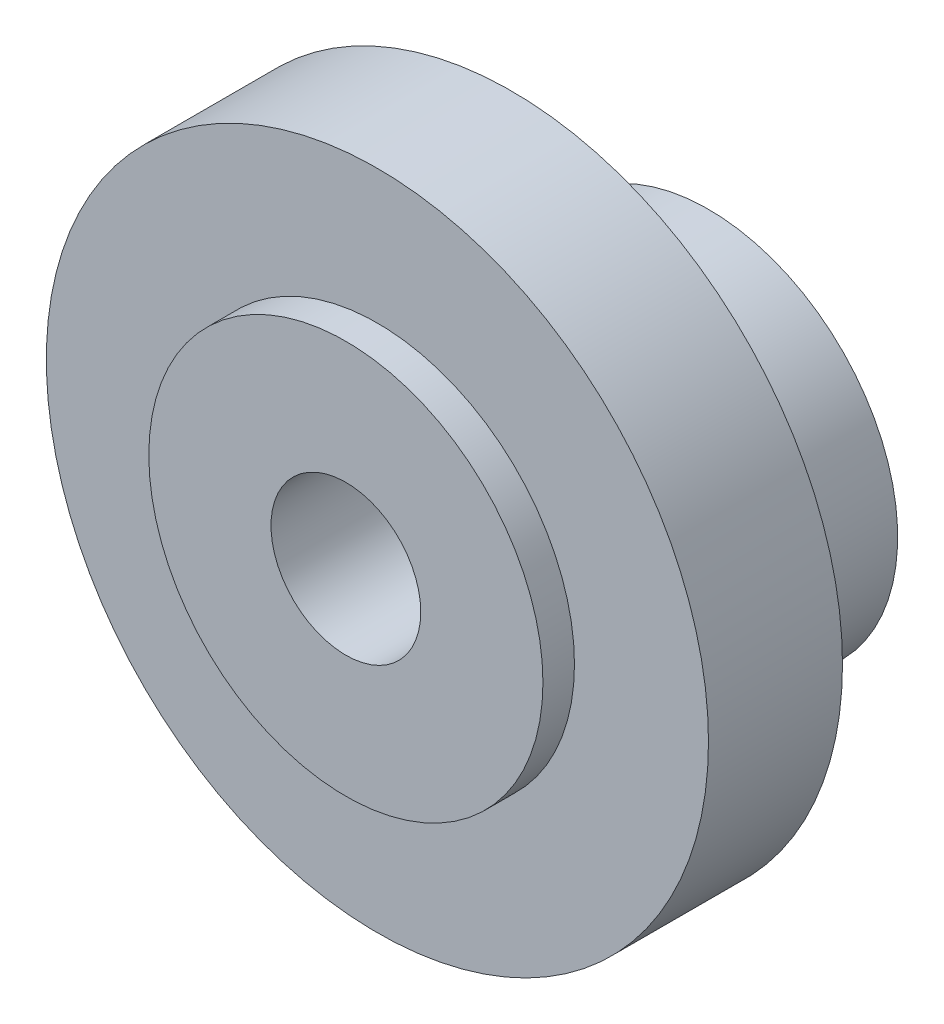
from build123d import *

# Parameters (mm, degrees)
ESQUISSE1_R             = 24
EXTRUSION1_DEPTH        = 13
ESQUISSE3_R             = 25
EXTRUSION3_DEPTH        = 12
ESQUISSE2_R             = 28
EXTRUSION4_DEPTH        = 2
ESQUISSE4_R             = 42
EXTRUSION5_DEPTH        = 17
ESQUISSE5_R             = 25
EXTRUSION6_DEPTH        = 4
ESQUISSE6_R             = 9.5
ENL_V_MAT_EXTRU_2_DEPTH = 80.562868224


with BuildPart() as part:
    # Esquisse1 → Extrusion1 (new body)
    with BuildSketch(Plane.XY):
        with Locations(Location((0, 0, 0), (0, 0, 180))):
            Circle(ESQUISSE1_R)
    extrude(amount=EXTRUSION1_DEPTH)

    # Esquisse3 → Extrusion3 (add)
    with BuildSketch(Plane.XY.offset(13)):
        with Locations(Location((0, 7.5, 0), (0, 0, 196.299997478))):
            Circle(ESQUISSE3_R)
    extrude(amount=EXTRUSION3_DEPTH)

    # Esquisse2 → Extrusion4 (add)
    with BuildSketch(Plane.XY.offset(13)):
        Circle(ESQUISSE2_R)
    extrude(amount=EXTRUSION4_DEPTH)

    # Esquisse4 → Extrusion5 (add)
    with BuildSketch(Plane.XY.offset(25)):
        with Locations((0, 7.5)):
            Circle(ESQUISSE4_R)
    extrude(amount=EXTRUSION5_DEPTH)

    # Esquisse5 → Extrusion6 (add)
    with BuildSketch(Plane.XY.offset(42)):
        with Locations(Location((0, 7.5, 0), (0, 0, 164.097570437))):
            Circle(ESQUISSE5_R)
    extrude(amount=EXTRUSION6_DEPTH)

    # Esquisse6 → Enl_v. mat.-Extru.2 (cut, through all)
    with BuildSketch(Plane.XY.offset(46)):
        with Locations((0, 7.5)):
            Circle(ESQUISSE6_R)
    extrude(amount=-ENL_V_MAT_EXTRU_2_DEPTH, mode=Mode.SUBTRACT)


solid = part.part
